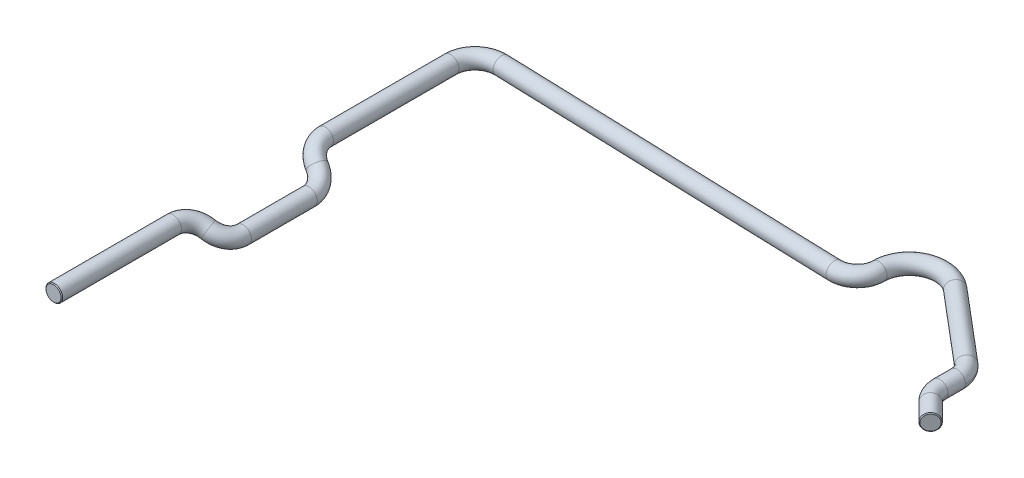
ISO-10303-21;
HEADER;
FILE_DESCRIPTION(('STEP AP214'),'2;1');
FILE_NAME('part.step','',(''),(''),'','','');
FILE_SCHEMA(('AUTOMOTIVE_DESIGN { 1 0 10303 214 1 1 1 1 }'));
ENDSEC;
DATA;
#1=APPLICATION_CONTEXT('core data for automotive mechanical design processes');
#2=APPLICATION_PROTOCOL_DEFINITION('international standard','automotive_design',2000,#1);
#3=PRODUCT_CONTEXT('',#1,'mechanical');
#4=PRODUCT('Part','Part','',(#3));
#5=PRODUCT_RELATED_PRODUCT_CATEGORY('part','',(#4));
#6=PRODUCT_DEFINITION_FORMATION('','',#4);
#7=PRODUCT_DEFINITION_CONTEXT('part definition',#1,'design');
#8=PRODUCT_DEFINITION('design','',#6,#7);
#9=PRODUCT_DEFINITION_SHAPE('','',#8);
#10=(LENGTH_UNIT() NAMED_UNIT(*) SI_UNIT(.MILLI.,.METRE.));
#11=(NAMED_UNIT(*) PLANE_ANGLE_UNIT() SI_UNIT($,.RADIAN.));
#12=(NAMED_UNIT(*) SI_UNIT($,.STERADIAN.) SOLID_ANGLE_UNIT());
#13=UNCERTAINTY_MEASURE_WITH_UNIT(LENGTH_MEASURE(1.E-05),#10,'distance_accuracy_value','');
#14=(GEOMETRIC_REPRESENTATION_CONTEXT(3) GLOBAL_UNCERTAINTY_ASSIGNED_CONTEXT((#13)) GLOBAL_UNIT_ASSIGNED_CONTEXT((#10,
#11,#12)) REPRESENTATION_CONTEXT('',''));
#15=CARTESIAN_POINT('',(0.,0.,0.));
#16=DIRECTION('',(0.,0.,1.));
#17=DIRECTION('',(1.,0.,0.));
#18=AXIS2_PLACEMENT_3D('',#15,#16,#17);
#19=CARTESIAN_POINT('',(-2.245881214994,3.798011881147,2.165278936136));
#20=DIRECTION('',(0.,0.,1.));
#21=DIRECTION('',(0.84892831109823,-0.528508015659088,0.));
#22=AXIS2_PLACEMENT_3D('',#19,#20,#21);
#23=PLANE('',#22);
#24=CARTESIAN_POINT('',(-0.784617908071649,4.1379329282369,2.165278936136));
#25=DIRECTION('',(0.,0.,1.));
#26=DIRECTION('',(1.,0.,0.));
#27=AXIS2_PLACEMENT_3D('',#24,#25,#26);
#28=CIRCLE('',#27,0.949974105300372);
#29=CARTESIAN_POINT('',(0.165356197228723,4.1379329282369,2.165278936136));
#30=VERTEX_POINT('',#29);
#31=EDGE_CURVE('E19',#30,#30,#28,.T.);
#32=ORIENTED_EDGE('',*,*,#31,.T.);
#33=EDGE_LOOP('',(#32));
#34=FACE_BOUND('',#33,.T.);
#35=ADVANCED_FACE('F15',(#34),#23,.T.);
#36=CARTESIAN_POINT('',(-0.78461790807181,4.137932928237,2.16528128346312));
#37=DIRECTION('',(1.99971353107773E-13,0.,-1.));
#38=DIRECTION('',(-1.,0.,-1.99971353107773E-13));
#39=AXIS2_PLACEMENT_3D('',#36,#37,#38);
#40=CONICAL_SURFACE('',#39,0.949971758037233,0.785384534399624);
#41=CARTESIAN_POINT('',(-0.7846179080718,4.137932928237,2.06525031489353));
#42=DIRECTION('',(0.,0.,1.));
#43=DIRECTION('',(0.848928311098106,-0.528508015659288,0.));
#44=AXIS2_PLACEMENT_3D('',#41,#42,#43);
#45=CIRCLE('',#44,1.04999999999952);
#46=CARTESIAN_POINT('',(0.106756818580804,3.582999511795,2.06525031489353));
#47=VERTEX_POINT('',#46);
#48=EDGE_CURVE('E199',#47,#47,#45,.T.);
#49=ORIENTED_EDGE('',*,*,#48,.T.);
#50=EDGE_LOOP('',(#49));
#51=FACE_BOUND('',#50,.T.);
#52=ORIENTED_EDGE('',*,*,#31,.F.);
#53=EDGE_LOOP('',(#52));
#54=FACE_BOUND('',#53,.T.);
#55=ADVANCED_FACE('F422',(#51,#54),#40,.T.);
#56=CARTESIAN_POINT('',(-0.7846179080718,4.137932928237,-12.9047210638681));
#57=DIRECTION('',(0.,0.,1.));
#58=DIRECTION('',(1.,0.,0.));
#59=AXIS2_PLACEMENT_3D('',#56,#57,#58);
#60=CYLINDRICAL_SURFACE('',#59,1.0499999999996);
#61=CARTESIAN_POINT('',(-0.7846179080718,4.137932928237,-12.9047210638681));
#62=DIRECTION('',(0.,0.,1.));
#63=DIRECTION('',(1.,0.,0.));
#64=AXIS2_PLACEMENT_3D('',#61,#62,#63);
#65=CIRCLE('',#64,1.0499999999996);
#66=CARTESIAN_POINT('',(0.265382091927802,4.137932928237,-12.9047210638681));
#67=VERTEX_POINT('',#66);
#68=EDGE_CURVE('E201',#67,#67,#65,.T.);
#69=ORIENTED_EDGE('',*,*,#68,.T.);
#70=EDGE_LOOP('',(#69));
#71=FACE_BOUND('',#70,.T.);
#72=ORIENTED_EDGE('',*,*,#48,.F.);
#73=EDGE_LOOP('',(#72));
#74=FACE_BOUND('',#73,.T.);
#75=ADVANCED_FACE('F262',(#71,#74),#60,.T.);
#76=CARTESIAN_POINT('',(1.63448820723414,2.63189648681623,-12.90472106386));
#77=DIRECTION('',(0.528508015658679,0.848928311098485,0.));
#78=DIRECTION('',(-0.179529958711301,0.111768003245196,-0.97738268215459));
#79=AXIS2_PLACEMENT_3D('',#76,#77,#78);
#80=TOROIDAL_SURFACE('',#79,2.84960000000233,1.05);
#81=ORIENTED_EDGE('',*,*,#68,.F.);
#82=EDGE_LOOP('',(#81));
#83=FACE_BOUND('',#82,.T.);
#84=CARTESIAN_POINT('',(0.913141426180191,3.08097746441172,-15.6246852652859));
#85=DIRECTION('',(0.810308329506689,-0.504464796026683,-0.298187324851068));
#86=DIRECTION('',(-0.307317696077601,0.0674408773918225,-0.94921418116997));
#87=AXIS2_PLACEMENT_3D('',#84,#85,#86);
#88=CIRCLE('',#87,1.05);
#89=CARTESIAN_POINT('',(0.59045784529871,3.15179038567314,-16.6213601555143));
#90=VERTEX_POINT('',#89);
#91=EDGE_CURVE('E257',#90,#90,#88,.F.);
#92=ORIENTED_EDGE('',*,*,#91,.T.);
#93=EDGE_LOOP('',(#92));
#94=FACE_BOUND('',#93,.T.);
#95=ADVANCED_FACE('F192',(#83,#94),#80,.T.);
#96=CARTESIAN_POINT('',(0.191989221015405,3.52993730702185,-18.34472106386));
#97=DIRECTION('',(0.528508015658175,0.848928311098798,0.));
#98=DIRECTION('',(0.845518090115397,-0.52638495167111,-0.0895435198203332));
#99=AXIS2_PLACEMENT_3D('',#96,#97,#98);
#100=TOROIDAL_SURFACE('',#99,2.84959999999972,1.05);
#101=ORIENTED_EDGE('',*,*,#91,.F.);
#102=EDGE_LOOP('',(#101));
#103=FACE_BOUND('',#102,.T.);
#104=CARTESIAN_POINT('',(2.61109533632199,2.02390086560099,-18.3447210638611));
#105=DIRECTION('',(0.,0.,1.));
#106=DIRECTION('',(0.,-1.,0.));
#107=AXIS2_PLACEMENT_3D('',#104,#105,#106);
#108=CIRCLE('',#107,1.04999999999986);
#109=CARTESIAN_POINT('',(2.61109533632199,0.97390086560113,-18.3447210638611));
#110=VERTEX_POINT('',#109);
#111=EDGE_CURVE('E254',#110,#110,#108,.T.);
#112=ORIENTED_EDGE('',*,*,#111,.T.);
#113=EDGE_LOOP('',(#112));
#114=FACE_BOUND('',#113,.T.);
#115=ADVANCED_FACE('F188',(#103,#114),#100,.T.);
#116=CARTESIAN_POINT('',(2.611095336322,2.023900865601,-26.6447210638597));
#117=DIRECTION('',(0.,0.,1.));
#118=DIRECTION('',(0.,-1.,0.));
#119=AXIS2_PLACEMENT_3D('',#116,#117,#118);
#120=CYLINDRICAL_SURFACE('',#119,1.04999999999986);
#121=ORIENTED_EDGE('',*,*,#111,.F.);
#122=EDGE_LOOP('',(#121));
#123=FACE_BOUND('',#122,.T.);
#124=CARTESIAN_POINT('',(2.611095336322,2.023900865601,-26.6447210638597));
#125=DIRECTION('',(0.,0.,1.));
#126=DIRECTION('',(0.,-1.,0.));
#127=AXIS2_PLACEMENT_3D('',#124,#125,#126);
#128=CIRCLE('',#127,1.04999999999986);
#129=CARTESIAN_POINT('',(2.611095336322,0.973900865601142,-26.6447210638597));
#130=VERTEX_POINT('',#129);
#131=EDGE_CURVE('E251',#130,#130,#128,.T.);
#132=ORIENTED_EDGE('',*,*,#131,.T.);
#133=EDGE_LOOP('',(#132));
#134=FACE_BOUND('',#133,.T.);
#135=ADVANCED_FACE('F184',(#123,#134),#120,.T.);
#136=CARTESIAN_POINT('',(0.191989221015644,3.52993730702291,-26.64472106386));
#137=DIRECTION('',(0.528508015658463,0.848928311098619,0.));
#138=DIRECTION('',(0.179529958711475,-0.111768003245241,-0.977382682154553));
#139=AXIS2_PLACEMENT_3D('',#136,#137,#138);
#140=TOROIDAL_SURFACE('',#139,2.84960000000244,1.05);
#141=ORIENTED_EDGE('',*,*,#131,.F.);
#142=EDGE_LOOP('',(#141));
#143=FACE_BOUND('',#142,.T.);
#144=CARTESIAN_POINT('',(0.913336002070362,3.08085632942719,-29.3646852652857));
#145=DIRECTION('',(0.810308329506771,-0.504464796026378,0.298187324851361));
#146=DIRECTION('',(0.19615407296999,-0.246000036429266,-0.949214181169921));
#147=AXIS2_PLACEMENT_3D('',#144,#145,#146);
#148=CIRCLE('',#147,1.05);
#149=CARTESIAN_POINT('',(1.11929777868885,2.82255629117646,-30.3613601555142));
#150=VERTEX_POINT('',#149);
#151=EDGE_CURVE('E248',#150,#150,#148,.T.);
#152=ORIENTED_EDGE('',*,*,#151,.T.);
#153=EDGE_LOOP('',(#152));
#154=FACE_BOUND('',#153,.T.);
#155=ADVANCED_FACE('F180',(#143,#154),#140,.T.);
#156=CARTESIAN_POINT('',(1.63448820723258,2.63189648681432,-32.08472106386));
#157=DIRECTION('',(0.528508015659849,0.848928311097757,0.));
#158=DIRECTION('',(-0.84551809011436,0.526384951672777,-0.0895435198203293));
#159=AXIS2_PLACEMENT_3D('',#156,#157,#158);
#160=TOROIDAL_SURFACE('',#159,2.84959999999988,1.05);
#161=ORIENTED_EDGE('',*,*,#151,.F.);
#162=EDGE_LOOP('',(#161));
#163=FACE_BOUND('',#162,.T.);
#164=CARTESIAN_POINT('',(-0.7846179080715,4.137932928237,-32.0847210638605));
#165=DIRECTION('',(0.,0.,1.));
#166=DIRECTION('',(1.,0.,0.));
#167=AXIS2_PLACEMENT_3D('',#164,#165,#166);
#168=CIRCLE('',#167,1.04999999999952);
#169=CARTESIAN_POINT('',(0.265382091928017,4.137932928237,-32.0847210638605));
#170=VERTEX_POINT('',#169);
#171=EDGE_CURVE('E245',#170,#170,#168,.T.);
#172=ORIENTED_EDGE('',*,*,#171,.T.);
#173=EDGE_LOOP('',(#172));
#174=FACE_BOUND('',#173,.T.);
#175=ADVANCED_FACE('F177',(#163,#174),#160,.T.);
#176=CARTESIAN_POINT('',(-0.7846179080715,4.137932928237,-47.8997210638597));
#177=DIRECTION('',(0.,0.,1.));
#178=DIRECTION('',(1.,0.,0.));
#179=AXIS2_PLACEMENT_3D('',#176,#177,#178);
#180=CYLINDRICAL_SURFACE('',#179,1.04999999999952);
#181=ORIENTED_EDGE('',*,*,#171,.F.);
#182=EDGE_LOOP('',(#181));
#183=FACE_BOUND('',#182,.T.);
#184=CARTESIAN_POINT('',(-0.7846179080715,4.137932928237,-47.8997210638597));
#185=DIRECTION('',(0.,0.,1.));
#186=DIRECTION('',(1.,0.,0.));
#187=AXIS2_PLACEMENT_3D('',#184,#185,#186);
#188=CIRCLE('',#187,1.04999999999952);
#189=CARTESIAN_POINT('',(0.265382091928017,4.137932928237,-47.8997210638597));
#190=VERTEX_POINT('',#189);
#191=EDGE_CURVE('E242',#190,#190,#188,.T.);
#192=ORIENTED_EDGE('',*,*,#191,.T.);
#193=EDGE_LOOP('',(#192));
#194=FACE_BOUND('',#193,.T.);
#195=ADVANCED_FACE('F168',(#183,#194),#180,.T.);
#196=CARTESIAN_POINT('',(2.41361406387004,4.0315738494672,-47.89972106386));
#197=DIRECTION('',(0.0332372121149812,0.999447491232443,0.));
#198=DIRECTION('',(-0.99663335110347,0.0331436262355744,0.0749897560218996));
#199=AXIS2_PLACEMENT_3D('',#196,#197,#198);
#200=TOROIDAL_SURFACE('',#199,3.19999999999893,1.05);
#201=CARTESIAN_POINT('',(2.41361406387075,4.03157384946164,-51.09972106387));
#202=DIRECTION('',(0.99944749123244,-0.0332372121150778,0.));
#203=DIRECTION('',(0.0332372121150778,0.99944749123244,0.));
#204=AXIS2_PLACEMENT_3D('',#201,#202,#203);
#205=CIRCLE('',#204,1.04999999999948);
#206=CARTESIAN_POINT('',(2.44851313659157,5.08099371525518,-51.09972106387));
#207=VERTEX_POINT('',#206);
#208=EDGE_CURVE('E237',#207,#207,#205,.F.);
#209=ORIENTED_EDGE('',*,*,#208,.T.);
#210=EDGE_LOOP('',(#209));
#211=FACE_BOUND('',#210,.T.);
#212=ORIENTED_EDGE('',*,*,#191,.F.);
#213=EDGE_LOOP('',(#212));
#214=FACE_BOUND('',#213,.T.);
#215=ADVANCED_FACE('F164',(#211,#214),#200,.T.);
#216=CARTESIAN_POINT('',(2.41361406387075,4.03157384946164,-51.09972106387));
#217=DIRECTION('',(0.99944749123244,-0.0332372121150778,0.));
#218=DIRECTION('',(0.0332372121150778,0.99944749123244,0.));
#219=AXIS2_PLACEMENT_3D('',#216,#217,#218);
#220=CYLINDRICAL_SURFACE('',#219,1.04999999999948);
#221=ORIENTED_EDGE('',*,*,#208,.F.);
#222=EDGE_LOOP('',(#221));
#223=FACE_BOUND('',#222,.T.);
#224=CARTESIAN_POINT('',(44.3904086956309,2.63561094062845,-51.0997210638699));
#225=DIRECTION('',(0.99944749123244,-0.0332372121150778,0.));
#226=DIRECTION('',(0.0332372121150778,0.99944749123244,0.));
#227=AXIS2_PLACEMENT_3D('',#224,#225,#226);
#228=CIRCLE('',#227,1.04999999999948);
#229=CARTESIAN_POINT('',(44.4253077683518,3.68503080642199,-51.0997210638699));
#230=VERTEX_POINT('',#229);
#231=EDGE_CURVE('E232',#230,#230,#228,.F.);
#232=ORIENTED_EDGE('',*,*,#231,.T.);
#233=EDGE_LOOP('',(#232));
#234=FACE_BOUND('',#233,.T.);
#235=ADVANCED_FACE('F160',(#223,#234),#220,.T.);
#236=CARTESIAN_POINT('',(44.3904086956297,2.63561094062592,-53.89972106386));
#237=DIRECTION('',(0.0332372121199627,0.999447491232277,0.));
#238=DIRECTION('',(-0.0919811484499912,0.00305888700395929,0.995756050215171));
#239=AXIS2_PLACEMENT_3D('',#236,#237,#238);
#240=TOROIDAL_SURFACE('',#239,2.7999999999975,1.05);
#241=CARTESIAN_POINT('',(47.1888616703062,2.54254674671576,-53.8996553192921));
#242=DIRECTION('',(-2.34672305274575E-05,7.80413045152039E-07,0.99999999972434));
#243=DIRECTION('',(0.99040961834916,-0.138162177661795,2.33499943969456E-05));
#244=AXIS2_PLACEMENT_3D('',#241,#242,#243);
#245=CIRCLE('',#244,1.05);
#246=CARTESIAN_POINT('',(48.2382815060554,2.50764767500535,-53.8997059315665));
#247=VERTEX_POINT('',#246);
#248=CARTESIAN_POINT('',(46.1394418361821,2.57744581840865,-53.8997519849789));
#249=VERTEX_POINT('',#248);
#250=EDGE_CURVE('E227',#247,#249,#245,.T.);
#251=ORIENTED_EDGE('',*,*,#250,.T.);
#252=CARTESIAN_POINT('',(47.1888616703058,2.54254674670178,-53.8996553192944));
#253=DIRECTION('',(-2.34672290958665E-05,7.80427182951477E-07,0.99999999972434));
#254=DIRECTION('',(-0.990409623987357,0.138162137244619,-2.33499950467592E-05));
#255=AXIS2_PLACEMENT_3D('',#252,#253,#254);
#256=CIRCLE('',#255,1.05);
#257=EDGE_CURVE('E76',#249,#247,#256,.T.);
#258=ORIENTED_EDGE('',*,*,#257,.T.);
#259=EDGE_LOOP('',(#251,#258));
#260=FACE_BOUND('',#259,.T.);
#261=ORIENTED_EDGE('',*,*,#231,.F.);
#262=EDGE_LOOP('',(#261));
#263=FACE_BOUND('',#262,.T.);
#264=ADVANCED_FACE('F156',(#260,#263),#240,.T.);
#265=CARTESIAN_POINT('',(51.1866516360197,2.40959789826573,-53.89972106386));
#266=DIRECTION('',(0.0332372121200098,0.999447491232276,0.));
#267=DIRECTION('',(-0.997511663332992,0.033172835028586,0.0622096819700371));
#268=AXIS2_PLACEMENT_3D('',#265,#266,#267);
#269=TOROIDAL_SURFACE('',#268,3.99999999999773,1.05);
#270=CARTESIAN_POINT('',(53.7563814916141,2.32414002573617,-56.963898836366));
#271=DIRECTION('',(0.765621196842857,-0.0254611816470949,0.642787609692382));
#272=DIRECTION('',(0.642996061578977,0.,-0.765869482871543));
#273=AXIS2_PLACEMENT_3D('',#270,#271,#272);
#274=CIRCLE('',#273,1.04999999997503);
#275=CARTESIAN_POINT('',(54.4315273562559,2.32414002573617,-57.768061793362));
#276=VERTEX_POINT('',#275);
#277=EDGE_CURVE('E224',#276,#276,#274,.F.);
#278=ORIENTED_EDGE('',*,*,#277,.T.);
#279=EDGE_LOOP('',(#278));
#280=FACE_BOUND('',#279,.T.);
#281=ORIENTED_EDGE('',*,*,#257,.F.);
#282=ORIENTED_EDGE('',*,*,#250,.F.);
#283=EDGE_LOOP('',(#281,#282));
#284=FACE_BOUND('',#283,.T.);
#285=ADVANCED_FACE('F153',(#280,#284),#269,.T.);
#286=CARTESIAN_POINT('',(53.7563814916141,2.32414002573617,-56.9638988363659));
#287=DIRECTION('',(0.765621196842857,-0.0254611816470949,0.642787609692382));
#288=DIRECTION('',(0.642996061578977,0.,-0.765869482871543));
#289=AXIS2_PLACEMENT_3D('',#286,#287,#288);
#290=CYLINDRICAL_SURFACE('',#289,1.04999999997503);
#291=CARTESIAN_POINT('',(62.3802689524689,2.03734759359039,-49.7235977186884));
#292=DIRECTION('',(0.765621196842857,-0.0254611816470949,0.642787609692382));
#293=DIRECTION('',(0.642996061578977,0.,-0.765869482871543));
#294=AXIS2_PLACEMENT_3D('',#291,#292,#293);
#295=CIRCLE('',#294,1.04999999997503);
#296=CARTESIAN_POINT('',(61.705714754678,2.05977695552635,-48.9192510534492));
#297=VERTEX_POINT('',#296);
#298=CARTESIAN_POINT('',(63.0548252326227,2.0149114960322,-50.5279424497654));
#299=VERTEX_POINT('',#298);
#300=EDGE_CURVE('E70',#297,#299,#295,.F.);
#301=ORIENTED_EDGE('',*,*,#300,.T.);
#302=CARTESIAN_POINT('',(62.380268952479,2.03734759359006,-49.7235977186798));
#303=DIRECTION('',(0.765621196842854,-0.0254611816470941,0.642787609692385));
#304=DIRECTION('',(0.64299606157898,0.,-0.76586948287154));
#305=AXIS2_PLACEMENT_3D('',#302,#303,#304);
#306=CIRCLE('',#305,1.04999999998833);
#307=EDGE_CURVE('E64',#299,#297,#306,.F.);
#308=ORIENTED_EDGE('',*,*,#307,.T.);
#309=EDGE_LOOP('',(#301,#308));
#310=FACE_BOUND('',#309,.T.);
#311=ORIENTED_EDGE('',*,*,#277,.F.);
#312=EDGE_LOOP('',(#311));
#313=FACE_BOUND('',#312,.T.);
#314=ADVANCED_FACE('F145',(#310,#313),#290,.T.);
#315=CARTESIAN_POINT('',(60.58145805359,2.0971681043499,-47.57867327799));
#316=DIRECTION('',(0.0332372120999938,0.999447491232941,0.));
#317=DIRECTION('',(0.569179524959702,-0.0189283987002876,-0.821995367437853));
#318=AXIS2_PLACEMENT_3D('',#315,#316,#317);
#319=TOROIDAL_SURFACE('',#318,2.8000000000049,1.05);
#320=CARTESIAN_POINT('',(63.37991102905,2.00410391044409,-47.5786732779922));
#321=DIRECTION('',(0.,-9.98316103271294E-13,1.));
#322=DIRECTION('',(0.,-1.,-9.98316103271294E-13));
#323=AXIS2_PLACEMENT_3D('',#320,#321,#322);
#324=CIRCLE('',#323,1.04999999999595);
#325=CARTESIAN_POINT('',(64.4293307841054,1.96920150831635,-47.5786762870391));
#326=VERTEX_POINT('',#325);
#327=CARTESIAN_POINT('',(62.3304910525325,2.03899965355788,-47.5786732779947));
#328=VERTEX_POINT('',#327);
#329=EDGE_CURVE('E215',#326,#328,#324,.F.);
#330=ORIENTED_EDGE('',*,*,#329,.T.);
#331=CARTESIAN_POINT('',(60.5814578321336,2.0971614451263,-47.57867327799));
#332=DIRECTION('',(0.0332372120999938,0.999447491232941,0.));
#333=DIRECTION('',(0.569179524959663,-0.0189283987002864,-0.82199536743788));
#334=AXIS2_PLACEMENT_3D('',#331,#332,#333);
#335=CIRCLE('',#334,1.75000000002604);
#336=EDGE_CURVE('E218',#328,#297,#335,.T.);
#337=ORIENTED_EDGE('',*,*,#336,.T.);
#338=ORIENTED_EDGE('',*,*,#307,.F.);
#339=CARTESIAN_POINT('',(60.5814578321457,2.09716144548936,-47.57867327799));
#340=DIRECTION('',(0.0332372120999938,0.999447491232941,0.));
#341=DIRECTION('',(0.569179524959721,-0.0189283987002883,-0.82199536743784));
#342=AXIS2_PLACEMENT_3D('',#339,#340,#341);
#343=CIRCLE('',#342,3.84999999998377);
#344=EDGE_CURVE('E220',#299,#326,#343,.F.);
#345=ORIENTED_EDGE('',*,*,#344,.T.);
#346=EDGE_LOOP('',(#330,#337,#338,#345));
#347=FACE_BOUND('',#346,.T.);
#348=ADVANCED_FACE('F142',(#347),#319,.T.);
#349=CARTESIAN_POINT('',(60.5814580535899,2.09716810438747,-47.57867327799));
#350=DIRECTION('',(0.0332372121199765,0.999447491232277,0.));
#351=DIRECTION('',(0.569179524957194,-0.0189283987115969,-0.821995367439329));
#352=AXIS2_PLACEMENT_3D('',#349,#350,#351);
#353=TOROIDAL_SURFACE('',#352,2.79999999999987,1.05);
#354=CARTESIAN_POINT('',(63.37991102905,2.004103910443,-47.5786732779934));
#355=DIRECTION('',(0.,0.,1.));
#356=DIRECTION('',(0.,-1.,0.));
#357=AXIS2_PLACEMENT_3D('',#354,#355,#356);
#358=CIRCLE('',#357,1.04999999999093);
#359=EDGE_CURVE('E212',#328,#326,#358,.F.);
#360=ORIENTED_EDGE('',*,*,#359,.T.);
#361=ORIENTED_EDGE('',*,*,#344,.F.);
#362=ORIENTED_EDGE('',*,*,#300,.F.);
#363=ORIENTED_EDGE('',*,*,#336,.F.);
#364=EDGE_LOOP('',(#360,#361,#362,#363));
#365=FACE_BOUND('',#364,.T.);
#366=ADVANCED_FACE('F139',(#365),#353,.T.);
#367=CARTESIAN_POINT('',(67.16323693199,2.939731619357,-41.9900610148));
#368=DIRECTION('',(0.706716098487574,-0.0235022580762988,0.707106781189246));
#369=DIRECTION('',(-0.706716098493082,0.0235022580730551,0.707106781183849));
#370=AXIS2_PLACEMENT_3D('',#367,#368,#369);
#371=PLANE('',#370);
#372=CARTESIAN_POINT('',(66.3782535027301,1.90439227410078,-41.2399230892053));
#373=DIRECTION('',(0.706716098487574,-0.0235022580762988,0.707106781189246));
#374=DIRECTION('',(0.707302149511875,0.,-0.70691135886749));
#375=AXIS2_PLACEMENT_3D('',#372,#373,#374);
#376=CIRCLE('',#375,0.9499741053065);
#377=CARTESIAN_POINT('',(65.7068915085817,1.92671878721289,-40.568189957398));
#378=VERTEX_POINT('',#377);
#379=CARTESIAN_POINT('',(67.0496154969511,1.88206576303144,-41.9116562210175));
#380=VERTEX_POINT('',#379);
#381=EDGE_CURVE('E210',#378,#380,#376,.T.);
#382=ORIENTED_EDGE('',*,*,#381,.T.);
#383=CARTESIAN_POINT('',(66.3782535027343,1.90439227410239,-41.2399230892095));
#384=DIRECTION('',(0.706716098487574,-0.0235022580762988,0.707106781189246));
#385=DIRECTION('',(0.707302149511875,0.,-0.70691135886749));
#386=AXIS2_PLACEMENT_3D('',#383,#384,#385);
#387=CIRCLE('',#386,0.949974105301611);
#388=EDGE_CURVE('E91',#380,#378,#387,.T.);
#389=ORIENTED_EDGE('',*,*,#388,.T.);
#390=EDGE_LOOP('',(#382,#389));
#391=FACE_BOUND('',#390,.T.);
#392=ADVANCED_FACE('F17',(#391),#371,.T.);
#393=CARTESIAN_POINT('',(63.37991102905,2.004103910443,-47.5786732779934));
#394=DIRECTION('',(0.,0.,1.));
#395=DIRECTION('',(0.,-1.,0.));
#396=AXIS2_PLACEMENT_3D('',#393,#394,#395);
#397=CYLINDRICAL_SURFACE('',#396,1.04999999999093);
#398=CARTESIAN_POINT('',(63.37991102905,2.00410391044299,-45.3997210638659));
#399=DIRECTION('',(0.,0.,1.));
#400=DIRECTION('',(0.,-1.,0.));
#401=AXIS2_PLACEMENT_3D('',#398,#399,#400);
#402=CIRCLE('',#401,1.04999999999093);
#403=CARTESIAN_POINT('',(62.3304910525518,2.03899965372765,-45.3997210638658));
#404=VERTEX_POINT('',#403);
#405=CARTESIAN_POINT('',(64.429330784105,1.96920150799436,-45.3997194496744));
#406=VERTEX_POINT('',#405);
#407=EDGE_CURVE('E95',#404,#406,#402,.F.);
#408=ORIENTED_EDGE('',*,*,#407,.T.);
#409=CARTESIAN_POINT('',(63.37991102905,2.00410391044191,-45.3997210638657));
#410=DIRECTION('',(0.,-9.98316103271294E-13,1.));
#411=DIRECTION('',(0.,-1.,-9.98316103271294E-13));
#412=AXIS2_PLACEMENT_3D('',#409,#410,#411);
#413=CIRCLE('',#412,1.04999999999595);
#414=EDGE_CURVE('E207',#406,#404,#413,.F.);
#415=ORIENTED_EDGE('',*,*,#414,.T.);
#416=EDGE_LOOP('',(#408,#415));
#417=FACE_BOUND('',#416,.T.);
#418=ORIENTED_EDGE('',*,*,#329,.F.);
#419=ORIENTED_EDGE('',*,*,#359,.F.);
#420=EDGE_LOOP('',(#418,#419));
#421=FACE_BOUND('',#420,.T.);
#422=ADVANCED_FACE('F135',(#417,#421),#397,.T.);
#423=CARTESIAN_POINT('',(66.378255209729,1.90439221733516,-41.2399213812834));
#424=DIRECTION('',(-0.706716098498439,0.0235022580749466,-0.707106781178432));
#425=DIRECTION('',(-0.707302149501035,0.,0.706911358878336));
#426=AXIS2_PLACEMENT_3D('',#423,#424,#425);
#427=CONICAL_SURFACE('',#426,0.949971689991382,0.785384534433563);
#428=CARTESIAN_POINT('',(66.3075616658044,1.90674317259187,-41.3106540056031));
#429=DIRECTION('',(0.706716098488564,-0.0235022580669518,0.707106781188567));
#430=DIRECTION('',(-0.706716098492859,0.0235022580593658,0.707106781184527));
#431=AXIS2_PLACEMENT_3D('',#428,#429,#430);
#432=CIRCLE('',#431,1.04999999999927);
#433=CARTESIAN_POINT('',(65.5655107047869,1.9314204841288,-40.5681918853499));
#434=VERTEX_POINT('',#433);
#435=CARTESIAN_POINT('',(67.0496135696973,1.88206581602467,-42.0531161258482));
#436=VERTEX_POINT('',#435);
#437=EDGE_CURVE('E100',#434,#436,#432,.T.);
#438=ORIENTED_EDGE('',*,*,#437,.T.);
#439=DIRECTION('',(1.36208429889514E-05,-4.72419437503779E-07,0.999999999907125));
#440=VECTOR('',#439,1.);
#441=CARTESIAN_POINT('',(67.0496145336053,1.88206579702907,-41.9823835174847));
#442=LINE('',#441,#440);
#443=EDGE_CURVE('E86',#436,#380,#442,.T.);
#444=ORIENTED_EDGE('',*,*,#443,.T.);
#445=ORIENTED_EDGE('',*,*,#381,.F.);
#446=DIRECTION('',(-0.999447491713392,0.0332371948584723,-1.36290102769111E-05));
#447=VECTOR('',#446,1.);
#448=CARTESIAN_POINT('',(65.6362032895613,1.92906956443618,-40.568190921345));
#449=LINE('',#448,#447);
#450=EDGE_CURVE('E96',#378,#434,#449,.T.);
#451=ORIENTED_EDGE('',*,*,#450,.T.);
#452=EDGE_LOOP('',(#438,#444,#445,#451));
#453=FACE_BOUND('',#452,.T.);
#454=ADVANCED_FACE('F103',(#453),#427,.T.);
#455=CARTESIAN_POINT('',(66.1783640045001,1.91103971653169,-45.39972106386));
#456=DIRECTION('',(0.0332372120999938,0.999447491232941,0.));
#457=DIRECTION('',(-0.995197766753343,0.033095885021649,-0.0921198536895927));
#458=AXIS2_PLACEMENT_3D('',#455,#456,#457);
#459=TOROIDAL_SURFACE('',#458,2.79999999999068,1.05);
#460=CARTESIAN_POINT('',(64.199558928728,1.97684603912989,-43.4198220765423));
#461=DIRECTION('',(0.706716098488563,-0.0235022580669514,0.707106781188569));
#462=DIRECTION('',(0.707302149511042,0.,-0.706911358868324));
#463=AXIS2_PLACEMENT_3D('',#460,#461,#462);
#464=CIRCLE('',#463,1.0499999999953);
#465=CARTESIAN_POINT('',(64.9416095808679,1.95216538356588,-44.1622853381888));
#466=VERTEX_POINT('',#465);
#467=CARTESIAN_POINT('',(63.4575044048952,2.0015201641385,-42.6773624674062));
#468=VERTEX_POINT('',#467);
#469=EDGE_CURVE('E33',#466,#468,#464,.F.);
#470=ORIENTED_EDGE('',*,*,#469,.T.);
#471=CARTESIAN_POINT('',(66.1783637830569,1.91103305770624,-45.39972106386));
#472=DIRECTION('',(0.0332372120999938,0.999447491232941,0.));
#473=DIRECTION('',(-0.99519776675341,0.0330958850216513,-0.0921198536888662));
#474=AXIS2_PLACEMENT_3D('',#471,#472,#473);
#475=CIRCLE('',#474,3.84999999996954);
#476=EDGE_CURVE('E104',#468,#404,#475,.F.);
#477=ORIENTED_EDGE('',*,*,#476,.T.);
#478=ORIENTED_EDGE('',*,*,#414,.F.);
#479=CARTESIAN_POINT('',(66.1783637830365,1.91103305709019,-45.39972106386));
#480=DIRECTION('',(0.0332372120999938,0.999447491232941,0.));
#481=DIRECTION('',(-0.995197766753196,0.0330958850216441,-0.0921198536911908));
#482=AXIS2_PLACEMENT_3D('',#479,#480,#481);
#483=CIRCLE('',#482,1.75000000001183);
#484=EDGE_CURVE('E108',#406,#466,#483,.T.);
#485=ORIENTED_EDGE('',*,*,#484,.T.);
#486=EDGE_LOOP('',(#470,#477,#478,#485));
#487=FACE_BOUND('',#486,.T.);
#488=ADVANCED_FACE('F127',(#487),#459,.T.);
#489=CARTESIAN_POINT('',(66.378255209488,1.90439221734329,-41.239921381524));
#490=DIRECTION('',(-0.706716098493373,0.0235022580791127,-0.707106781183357));
#491=DIRECTION('',(-0.707302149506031,0.,0.706911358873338));
#492=AXIS2_PLACEMENT_3D('',#489,#490,#491);
#493=CONICAL_SURFACE('',#492,0.949971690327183,0.785384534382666);
#494=CARTESIAN_POINT('',(66.3075616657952,1.90674317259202,-41.3106540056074));
#495=DIRECTION('',(0.706716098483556,-0.023502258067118,0.707106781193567));
#496=DIRECTION('',(0.706716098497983,-0.0235022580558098,-0.707106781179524));
#497=AXIS2_PLACEMENT_3D('',#494,#495,#496);
#498=CIRCLE('',#497,1.05000000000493);
#499=EDGE_CURVE('E25',#436,#434,#498,.T.);
#500=ORIENTED_EDGE('',*,*,#499,.T.);
#501=ORIENTED_EDGE('',*,*,#450,.F.);
#502=ORIENTED_EDGE('',*,*,#388,.F.);
#503=ORIENTED_EDGE('',*,*,#443,.F.);
#504=EDGE_LOOP('',(#500,#501,#502,#503));
#505=FACE_BOUND('',#504,.T.);
#506=ADVANCED_FACE('F88',(#505),#493,.T.);
#507=CARTESIAN_POINT('',(66.1783640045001,1.91103971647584,-45.39972106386));
#508=DIRECTION('',(0.0332372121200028,0.999447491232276,0.));
#509=DIRECTION('',(-0.995197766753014,0.0330958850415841,-0.0921198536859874));
#510=AXIS2_PLACEMENT_3D('',#507,#508,#509);
#511=TOROIDAL_SURFACE('',#510,2.79999999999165,1.05);
#512=CARTESIAN_POINT('',(64.1995589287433,1.97684603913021,-43.419822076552));
#513=DIRECTION('',(0.706716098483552,-0.0235022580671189,0.707106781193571));
#514=DIRECTION('',(0.707302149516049,0.,-0.706911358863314));
#515=AXIS2_PLACEMENT_3D('',#512,#513,#514);
#516=CIRCLE('',#515,1.04999999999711);
#517=EDGE_CURVE('E10',#468,#466,#516,.F.);
#518=ORIENTED_EDGE('',*,*,#517,.T.);
#519=ORIENTED_EDGE('',*,*,#484,.F.);
#520=ORIENTED_EDGE('',*,*,#407,.F.);
#521=ORIENTED_EDGE('',*,*,#476,.F.);
#522=EDGE_LOOP('',(#518,#519,#520,#521));
#523=FACE_BOUND('',#522,.T.);
#524=ADVANCED_FACE('F285',(#523),#511,.T.);
#525=CARTESIAN_POINT('',(64.1995589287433,1.97684603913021,-43.419822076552));
#526=DIRECTION('',(0.706716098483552,-0.0235022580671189,0.707106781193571));
#527=DIRECTION('',(0.707302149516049,0.,-0.706911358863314));
#528=AXIS2_PLACEMENT_3D('',#525,#526,#527);
#529=CYLINDRICAL_SURFACE('',#528,1.04999999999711);
#530=ORIENTED_EDGE('',*,*,#517,.F.);
#531=ORIENTED_EDGE('',*,*,#469,.F.);
#532=EDGE_LOOP('',(#530,#531));
#533=FACE_BOUND('',#532,.T.);
#534=ORIENTED_EDGE('',*,*,#437,.F.);
#535=ORIENTED_EDGE('',*,*,#499,.F.);
#536=EDGE_LOOP('',(#534,#535));
#537=FACE_BOUND('',#536,.T.);
#538=ADVANCED_FACE('F99',(#533,#537),#529,.T.);
#539=CLOSED_SHELL('',(#35,#55,#75,#95,#115,#135,#155,#175,#195,#215,#235,#264,#285,#314,#348,
#366,#392,#422,#454,#488,#506,#524,#538));
#540=MANIFOLD_SOLID_BREP('B1',#539);
#541=ADVANCED_BREP_SHAPE_REPRESENTATION('',(#18,#540),#14);
#542=SHAPE_DEFINITION_REPRESENTATION(#9,#541);
ENDSEC;
END-ISO-10303-21;
